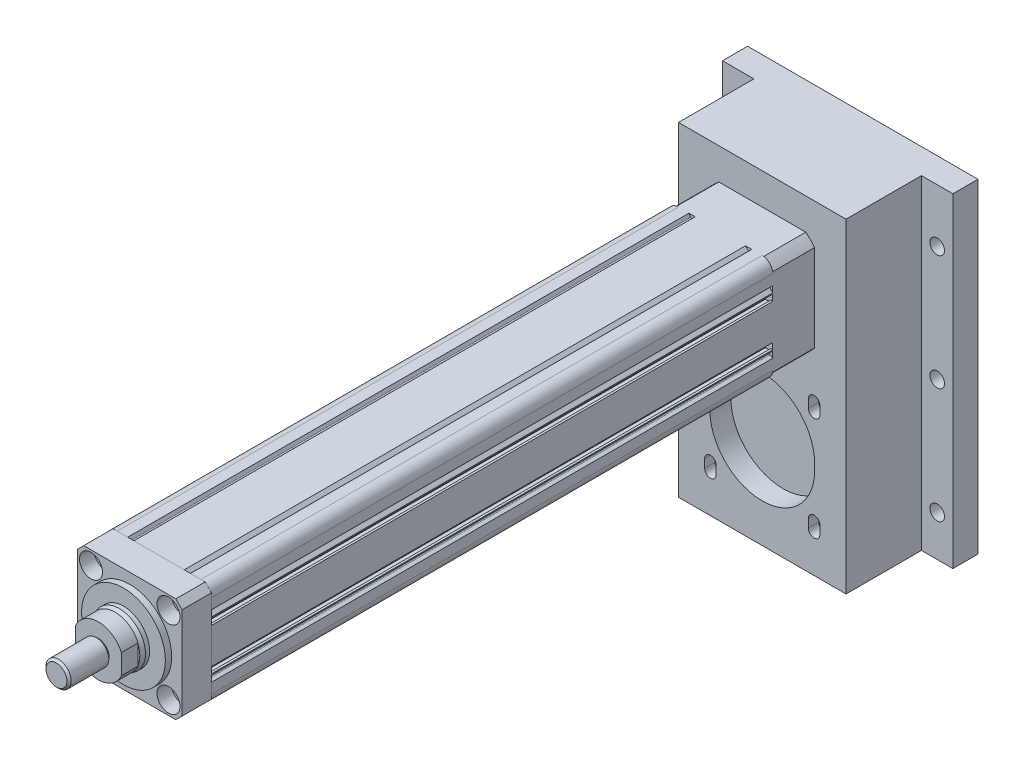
from build123d import *

# Parameters (mm, degrees)
SKETCH_1_R           = 20
SKETCH_1_R_2         = 2.75
EXTRUDE_1_DEPTH      = 268
FILLET_1_R           = 5
EXTRUDE_2_DEPTH      = 14
SKETCH_3_R           = 20
EXTRUDE_3_DEPTH      = 3
SKETCH_5_R           = 12.5
EXTRUDE_4_DEPTH      = 4
CHAMFER_1_SIZE       = 2
CHAMFER_1_SIZE2      = 0.7
EXTRUDE_5_DEPTH      = 8
SKETCH_7_R           = 5.15
EXTRUDE_6_DEPTH      = 1
SKETCH_8_R           = 6
EXTRUDE_7_DEPTH      = 19
CHAMFER_2_SIZE       = 1
SKETCH_23_W          = 50
SKETCH_23_H          = 50
EXTRUDE_8_DEPTH      = 20
SKETCH_24_R          = 42.5
SKETCH_24_R_2        = 32.5
CUT_EXTRUDE_1_DEPTH  = 20
SKETCH_4_R           = 3.5
CUT_EXTRUDE_5_DEPTH  = 30
SKETCH_4_6_R         = 5.5
CUT_EXTRUDE_6_DEPTH  = 7
SKETCH_35_W          = 80
SKETCH_35_H          = 155
EXTRUDE_10_DEPTH     = 36
CUT_EXTRUDE_11_DEPTH = 10
CUT_EXTRUDE_12_DEPTH = 10
CUT_EXTRUDE_START    = 10
CUT_EXTRUDE_13_DEPTH = 5
SKETCH_36_W          = 110
SKETCH_36_H          = 155
SKETCH_36_R          = 3.5
EXTRUDE_11_DEPTH     = 12


with BuildPart() as part:
    # Sketch 1 → Extrude 1 (new body)
    with BuildSketch(Plane.XY):
        with BuildLine():
            Line((-25, 25), (-15, 25))
            Line((-15, 25), (-14.227730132, 23.662389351))
            ThreePointArc((-14.227730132, 23.662389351), (-13.859980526, 23.416666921), (-13.441164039, 23.558835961))
            Line((-13.441164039, 23.558835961), (-12, 25))
            Line((-12, 25), (12, 25))
            Line((12, 25), (13.441164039, 23.558835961))
            ThreePointArc((13.441164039, 23.558835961), (13.859980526, 23.416666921), (14.227730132, 23.662389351))
            Line((14.227730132, 23.662389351), (15, 25))
            Line((15, 25), (25, 25))
            Line((25, 25), (25, 15))
            Line((25, 15), (23.662389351, 14.227730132))
            ThreePointArc((23.662389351, 14.227730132), (23.416666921, 13.859980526), (23.558835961, 13.441164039))
            Line((23.558835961, 13.441164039), (25, 12))
            Line((25, 12), (25, 11.5))
            Line((25, 11.5), (24, 11.5))
            Line((24, 11.5), (24, 12.4))
            Line((24, 12.4), (21.5, 12.4))
            Line((21.5, 12.4), (21.5, 7.6))
            Line((21.5, 7.6), (24, 7.6))
            Line((24, 7.6), (24, 8.5))
            Line((24, 8.5), (25, 8.5))
            Line((25, 8.5), (25, -8.5))
            Line((25, -8.5), (24, -8.5))
            Line((24, -8.5), (24, -7.6))
            Line((24, -7.6), (21.5, -7.6))
            Line((21.5, -7.6), (21.5, -12.4))
            Line((21.5, -12.4), (24, -12.4))
            Line((24, -12.4), (24, -11.5))
            Line((24, -11.5), (25, -11.5))
            Line((25, -11.5), (25, -12))
            Line((25, -12), (23.558835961, -13.441164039))
            ThreePointArc((23.558835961, -13.441164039), (23.416666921, -13.859980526), (23.662389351, -14.227730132))
            Line((23.662389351, -14.227730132), (25, -15))
            Line((25, -15), (25, -25))
            Line((25, -25), (15, -25))
            Line((15, -25), (14.227730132, -23.662389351))
            ThreePointArc((14.227730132, -23.662389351), (13.859980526, -23.416666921), (13.441164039, -23.558835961))
            Line((13.441164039, -23.558835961), (12, -25))
            Line((12, -25), (11.5, -25))
            Line((11.5, -25), (11.5, -24))
            Line((11.5, -24), (12.4, -24))
            Line((12.4, -24), (12.4, -21.5))
            Line((12.4, -21.5), (7.6, -21.5))
            Line((7.6, -21.5), (7.6, -24))
            Line((7.6, -24), (8.5, -24))
            Line((8.5, -24), (8.5, -25))
            Line((8.5, -25), (-8.5, -25))
            Line((-8.5, -25), (-8.5, -24))
            Line((-8.5, -24), (-7.6, -24))
            Line((-7.6, -24), (-7.6, -21.5))
            Line((-7.6, -21.5), (-12.4, -21.5))
            Line((-12.4, -21.5), (-12.4, -24))
            Line((-12.4, -24), (-11.5, -24))
            Line((-11.5, -24), (-11.5, -25))
            Line((-11.5, -25), (-12, -25))
            Line((-12, -25), (-13.441164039, -23.558835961))
            ThreePointArc((-13.441164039, -23.558835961), (-13.859980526, -23.416666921), (-14.227730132, -23.662389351))
            Line((-14.227730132, -23.662389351), (-15, -25))
            Line((-15, -25), (-25, -25))
            Line((-25, -25), (-25, -15))
            Line((-25, -15), (-23.662389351, -14.227730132))
            ThreePointArc((-23.662389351, -14.227730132), (-23.416666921, -13.859980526), (-23.558835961, -13.441164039))
            Line((-23.558835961, -13.441164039), (-25, -12))
            Line((-25, -12), (-25, -11.5))
            Line((-25, -11.5), (-24, -11.5))
            Line((-24, -11.5), (-24, -12.4))
            Line((-24, -12.4), (-21.5, -12.4))
            Line((-21.5, -12.4), (-21.5, -7.6))
            Line((-21.5, -7.6), (-24, -7.6))
            Line((-24, -7.6), (-24, -8.5))
            Line((-24, -8.5), (-25, -8.5))
            Line((-25, -8.5), (-25, 8.5))
            Line((-25, 8.5), (-24, 8.5))
            Line((-24, 8.5), (-24, 7.6))
            Line((-24, 7.6), (-21.5, 7.6))
            Line((-21.5, 7.6), (-21.5, 12.4))
            Line((-21.5, 12.4), (-24, 12.4))
            Line((-24, 12.4), (-24, 11.5))
            Line((-24, 11.5), (-25, 11.5))
            Line((-25, 11.5), (-25, 12))
            Line((-25, 12), (-23.558835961, 13.441164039))
            ThreePointArc((-23.558835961, 13.441164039), (-23.416666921, 13.859980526), (-23.662389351, 14.227730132))
            Line((-23.662389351, 14.227730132), (-25, 15))
            Line((-25, 15), (-25, 25))
        make_face()
        Circle(SKETCH_1_R, mode=Mode.SUBTRACT)
        with Locations((-18.5, 18.5)):
            Circle(SKETCH_1_R_2, mode=Mode.SUBTRACT)
        with Locations((18.5, 18.5)):
            Circle(SKETCH_1_R_2, mode=Mode.SUBTRACT)
        with Locations((18.5, -18.5)):
            Circle(SKETCH_1_R_2, mode=Mode.SUBTRACT)
        with Locations((-18.5, -18.5)):
            Circle(SKETCH_1_R_2, mode=Mode.SUBTRACT)
        with BuildLine():
            Line((-13.868836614, 23), (-5, 23))
            ThreePointArc((-5, 23), (-4.502985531, 22.554558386), (-4.891534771, 22.01190647))
            ThreePointArc((-4.891534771, 22.01190647), (-10.498377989, 19.955831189), (-15.368836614, 16.5))
            Line((-15.368836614, 16.5), (-15.368836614, 21.5))
            Line((-15.368836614, 21.5), (-13.868836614, 23))
        make_face(mode=Mode.SUBTRACT)
        with BuildLine():
            Line((15.368836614, 16.5), (15.368836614, 21.5))
            Line((15.368836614, 21.5), (13.868836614, 23))
            Line((13.868836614, 23), (5, 23))
            ThreePointArc((5, 23), (4.502985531, 22.554558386), (4.891534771, 22.01190647))
            ThreePointArc((4.891534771, 22.01190647), (10.498377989, 19.955831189), (15.368836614, 16.5))
        make_face(mode=Mode.SUBTRACT)
    extrude(amount=EXTRUDE_1_DEPTH)

    # Fillet 1
    fillet_1_edges = [part.edges().sort_by_distance(p)[0] for p in [
        (-25, 25, 134),
        (25, 25, 134),
        (25, -25, 134),
        (-25, -25, 134),
    ]]
    fillet(fillet_1_edges, radius=FILLET_1_R)

    # Sketch 23 → Extrude 8 (add)
    with BuildSketch(Plane(origin=(0, 0, 0), x_dir=(-1, 0, 0), z_dir=(0, 0, -1))):
        Rectangle(SKETCH_23_W, SKETCH_23_H)
    extrude(amount=EXTRUDE_8_DEPTH)

    # Sketch 24 → Cut-Extrude 1 (cut)
    with BuildSketch(Plane(origin=(0, 0, -20), x_dir=(-1, 0, 0), z_dir=(0, 0, -1))):
        Circle(SKETCH_24_R)
        Circle(SKETCH_24_R_2, mode=Mode.SUBTRACT)
    extrude(amount=-CUT_EXTRUDE_1_DEPTH, mode=Mode.SUBTRACT)

    # Sketch 27 → Hole Wizard M6 _1 (revolve, cut)
    with BuildSketch(Plane(origin=(0, -25, -12), x_dir=(0, 0, -1), z_dir=(1, 0, 0))):
        Polygon((0, 0), (0, 8.502151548), (2.5, 7), (2.5, 0), align=None)
    revolve(axis=Axis((0, -31.35, -12), (0, 1, 0)), mode=Mode.SUBTRACT)


with BuildPart() as body_2:
    # Sketch 2 → Extrude 2 (new body)
    with BuildSketch(Plane.XY.offset(268)):
        Polygon((-25, 22), (-22, 25), (22, 25), (25, 22), (25, -22), (22, -25), (-22, -25), (-25, -22), align=None)
    extrude(amount=EXTRUDE_2_DEPTH)


with BuildPart() as body_3:
    # Sketch 3 → Extrude 3 (new body)
    with BuildSketch(Plane.XY.offset(282)):
        Circle(SKETCH_3_R)
    extrude(amount=EXTRUDE_3_DEPTH)


with BuildPart() as body_4:
    # Sketch 5 → Extrude 4 (new body)
    with BuildSketch(Plane.XY.offset(285)):
        Circle(SKETCH_5_R)
    extrude(amount=EXTRUDE_4_DEPTH)

    # Chamfer 1
    chamfer_1_edges = [body_4.edges().sort_by_distance(p)[0] for p in [
        (-12.5, 0, 289),
    ]]
    chamfer_1_side = [body_4.faces().sort_by_distance(p)[0] for p in [
        (-12.5, 0, 287),
    ]]
    chamfer(chamfer_1_edges, length=CHAMFER_1_SIZE, length2=CHAMFER_1_SIZE2, reference=chamfer_1_side[0])


with BuildPart() as body_5:
    # Sketch 6 → Extrude 5 (new body)
    with BuildSketch(Plane.XY.offset(289)):
        with BuildLine():
            Line((-11, 4.795831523), (-11, -4.795831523))
            ThreePointArc((-11, -4.795831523), (0, -12), (11, -4.795831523))
            Line((11, -4.795831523), (11, 4.795831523))
            ThreePointArc((11, 4.795831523), (0, 12), (-11, 4.795831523))
        make_face()
    extrude(amount=EXTRUDE_5_DEPTH)


with BuildPart() as body_6:
    # Sketch 7 → Extrude 6 (new body)
    with BuildSketch(Plane.XY.offset(297)):
        Circle(SKETCH_7_R)
    extrude(amount=EXTRUDE_6_DEPTH)


with BuildPart() as body_7:
    # Sketch 8 → Extrude 7 (new body)
    with BuildSketch(Plane.XY.offset(298)):
        Circle(SKETCH_8_R)
    extrude(amount=EXTRUDE_7_DEPTH)

    # Chamfer 2
    chamfer_2_edges = [body_7.edges().sort_by_distance(p)[0] for p in [
        (-6, 0, 317),
    ]]
    chamfer(chamfer_2_edges, length=CHAMFER_2_SIZE)


with BuildPart() as cut_extrude_5_tool:
    # Sketch 4 → Cut-Extrude 5 (new body)
    with BuildSketch(Plane.XY.offset(282)):
        with Locations((-35, 17.5)):
            Circle(SKETCH_4_R)
        with Locations((-18.5, 18.5)):
            Circle(SKETCH_4_R)
        with Locations(Location((-18.5, -18.5, 0), (0, 0, 180))):
            Circle(SKETCH_4_R)
        with Locations((-35, -17.5)):
            Circle(SKETCH_4_R)
        with Locations((35, -17.5)):
            Circle(SKETCH_4_R)
        with Locations((18.5, -18.5)):
            Circle(SKETCH_4_R)
        with Locations(Location((18.5, 18.5, 0), (0, 0, 180))):
            Circle(SKETCH_4_R)
        with Locations((35, 17.5)):
            Circle(SKETCH_4_R)
    extrude(amount=-CUT_EXTRUDE_5_DEPTH)


with BuildPart() as part_1:
    add(part.part)

    # Cut-Extrude 5: cut by cut_extrude_5_tool
    add(cut_extrude_5_tool.part, mode=Mode.SUBTRACT)

    # Sketch 35 → Extrude 10 (add)
    with BuildSketch(Plane(origin=(0, 0, -20), x_dir=(-1, 0, 0), z_dir=(0, 0, -1))):
        with Locations((0, -37.5)):
            Rectangle(SKETCH_35_W, SKETCH_35_H)
    extrude(amount=EXTRUDE_10_DEPTH)

    # Sketch 35_3 → Cut-Extrude 11 (cut)
    with BuildSketch(Plane(origin=(0, 0, -20), x_dir=(-1, 0, 0), z_dir=(0, 0, -1))):
        with BuildLine():
            Line((25, -68.5), (25, -71.5))
            ThreePointArc((25, -71.5), (-0.002360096, -96.499999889), (-24.999999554, -71.495279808))
            Line((-24.999999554, -71.495279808), (-24.999464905, -68.663567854))
            ThreePointArc((-24.999464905, -68.663567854), (-0.081784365, -43.500133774), (25, -68.5))
        make_face()
    extrude(amount=CUT_EXTRUDE_11_DEPTH, mode=Mode.SUBTRACT)

    # Sketch 35_4 → Cut-Extrude 12 (cut)
    with BuildSketch(Plane(origin=(0, 0, -20), x_dir=(-1, 0, 0), z_dir=(0, 0, -1))):
        with BuildLine():
            Line((27.498737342, -92.748737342), (27.498737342, -96.748737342))
            ThreePointArc((27.498737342, -96.748737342), (24.748737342, -99.498737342), (21.998737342, -96.748737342))
            Line((21.998737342, -96.748737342), (21.998737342, -92.748737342))
            ThreePointArc((21.998737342, -92.748737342), (24.748737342, -89.998737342), (27.498737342, -92.748737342))
        make_face()
        with BuildLine():
            Line((-27.498737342, -92.748737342), (-27.498737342, -96.748737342))
            ThreePointArc((-27.498737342, -96.748737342), (-24.748737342, -99.498737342), (-21.998737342, -96.748737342))
            Line((-21.998737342, -96.748737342), (-21.998737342, -92.748737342))
            ThreePointArc((-21.998737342, -92.748737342), (-24.748737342, -89.998737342), (-27.498737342, -92.748737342))
        make_face()
        with BuildLine():
            Line((-27.498737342, -47.251262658), (-27.498737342, -43.251262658))
            ThreePointArc((-27.498737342, -43.251262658), (-24.748737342, -40.501262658), (-21.998737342, -43.251262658))
            Line((-21.998737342, -43.251262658), (-21.998737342, -47.251262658))
            ThreePointArc((-21.998737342, -47.251262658), (-24.748737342, -50.001262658), (-27.498737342, -47.251262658))
        make_face()
        with BuildLine():
            Line((27.498737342, -47.251262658), (27.498737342, -43.251262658))
            ThreePointArc((27.498737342, -43.251262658), (24.748737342, -40.501262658), (21.998737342, -43.251262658))
            Line((21.998737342, -43.251262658), (21.998737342, -47.251262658))
            ThreePointArc((21.998737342, -47.251262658), (24.748737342, -50.001262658), (27.498737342, -47.251262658))
        make_face()
    extrude(amount=CUT_EXTRUDE_12_DEPTH, mode=Mode.SUBTRACT)

    # Sketch 35_5 → Cut-Extrude 13 (cut)
    with BuildSketch(Plane(origin=(0, 0, -20), x_dir=(-1, 0, 0), z_dir=(0, 0, -1)).offset(CUT_EXTRUDE_START)):
        with BuildLine():
            Line((28.848737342, -91.848737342), (28.848737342, -97.648737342))
            ThreePointArc((28.848737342, -97.648737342), (24.748737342, -101.748737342), (20.648737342, -97.648737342))
            Line((20.648737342, -97.648737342), (20.648737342, -91.848737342))
            ThreePointArc((20.648737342, -91.848737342), (24.748737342, -87.748737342), (28.848737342, -91.848737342))
        make_face()
        with BuildLine():
            Line((-28.848737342, -91.848737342), (-28.848737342, -97.648737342))
            ThreePointArc((-28.848737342, -97.648737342), (-24.748737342, -101.748737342), (-20.648737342, -97.648737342))
            Line((-20.648737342, -97.648737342), (-20.648737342, -91.848737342))
            ThreePointArc((-20.648737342, -91.848737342), (-24.748737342, -87.748737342), (-28.848737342, -91.848737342))
        make_face()
        with BuildLine():
            Line((-28.848737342, -48.151262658), (-28.848737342, -42.351262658))
            ThreePointArc((-28.848737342, -42.351262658), (-24.748737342, -38.251262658), (-20.648737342, -42.351262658))
            Line((-20.648737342, -42.351262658), (-20.648737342, -48.151262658))
            ThreePointArc((-20.648737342, -48.151262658), (-24.748737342, -52.251262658), (-28.848737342, -48.151262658))
        make_face()
        with BuildLine():
            Line((28.848737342, -48.151262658), (28.848737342, -42.351262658))
            ThreePointArc((28.848737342, -42.351262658), (24.748737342, -38.251262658), (20.648737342, -42.351262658))
            Line((20.648737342, -42.351262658), (20.648737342, -48.151262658))
            ThreePointArc((20.648737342, -48.151262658), (24.748737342, -52.251262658), (28.848737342, -48.151262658))
        make_face()
    extrude(amount=-CUT_EXTRUDE_13_DEPTH, mode=Mode.SUBTRACT)

    # Sketch 36 → Extrude 11 (add)
    with BuildSketch(Plane(origin=(0, 0, -56), x_dir=(-1, 0, 0), z_dir=(0, 0, -1))):
        with Locations((0, -37.5)):
            Rectangle(SKETCH_36_W, SKETCH_36_H)
        with Locations((47.5, 14.5)):
            Circle(SKETCH_36_R, mode=Mode.SUBTRACT)
        with Locations((47.5, -40.5)):
            Circle(SKETCH_36_R, mode=Mode.SUBTRACT)
        with Locations((47.5, -95.5)):
            Circle(SKETCH_36_R, mode=Mode.SUBTRACT)
        with Locations(Location((-47.5, 14.5, 0), (0, 0, 180))):
            Circle(SKETCH_36_R, mode=Mode.SUBTRACT)
        with Locations(Location((-47.5, -40.5, 0), (0, 0, 180))):
            Circle(SKETCH_36_R, mode=Mode.SUBTRACT)
        with Locations(Location((-47.5, -95.5, 0), (0, 0, 180))):
            Circle(SKETCH_36_R, mode=Mode.SUBTRACT)
    extrude(amount=EXTRUDE_11_DEPTH)


with BuildPart() as body_2_1:
    add(body_2.part)

    # Cut-Extrude 5: cut by cut_extrude_5_tool
    add(cut_extrude_5_tool.part, mode=Mode.SUBTRACT)

    # Sketch 4_6 → Cut-Extrude 6 (cut)
    with BuildSketch(Plane.XY.offset(282)):
        with Locations((-18.5, 18.5)):
            Circle(SKETCH_4_6_R)
        with Locations(Location((-18.5, -18.5, 0), (0, 0, 180))):
            Circle(SKETCH_4_6_R)
        with Locations((18.5, -18.5)):
            Circle(SKETCH_4_6_R)
        with Locations(Location((18.5, 18.5, 0), (0, 0, 180))):
            Circle(SKETCH_4_6_R)
    extrude(amount=-CUT_EXTRUDE_6_DEPTH, mode=Mode.SUBTRACT)


solid = Compound([body_3.part, body_4.part, body_5.part, body_6.part, body_7.part, part_1.part, body_2_1.part])
